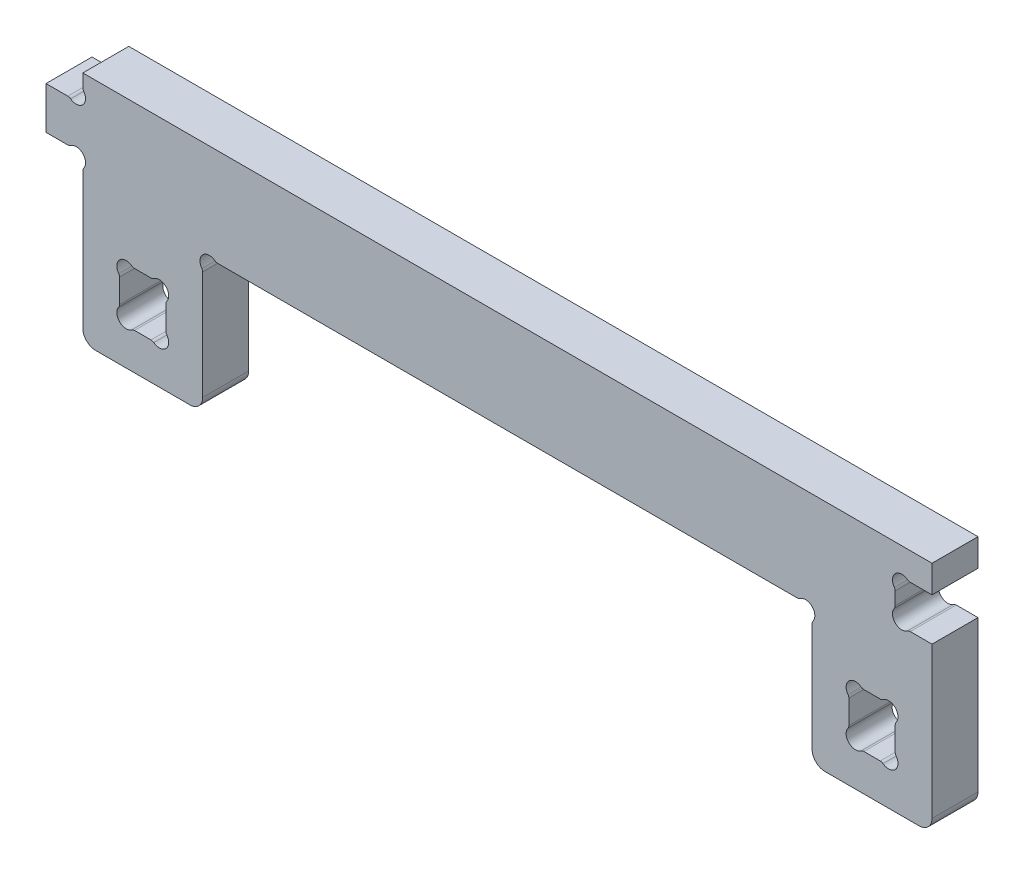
from build123d import *

# Parameters (mm, degrees)
BOSS_EXTRU_2_DEPTH = 25
CONG_1_R           = 7


with BuildPart() as part:
    # Esquisse2 → Boss.-Extru.2 (new body)
    with BuildSketch(Plane.XY):
        with BuildLine():
            Line((0, 0), (65.2, 0))
            Line((65.2, 0), (65.2, 89.066666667))
            Line((65.2, 89.066666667), (53.331040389, 89.066666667))
            ThreePointArc((53.331040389, 89.066666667), (52.547325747, 88.94064884), (51.842620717, 88.575299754))
            ThreePointArc((51.842620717, 88.575299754), (45.2, 89.066666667), (44.708633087, 95.709287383))
            ThreePointArc((44.708633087, 95.709287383), (45.073982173, 96.413992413), (45.2, 97.197707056))
            Line((45.2, 97.197707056), (45.2, 104.135626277))
            ThreePointArc((45.2, 104.135626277), (45.073982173, 104.91934092), (44.708633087, 105.62404595))
            ThreePointArc((44.708633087, 105.62404595), (45.2, 112.266666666), (51.842620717, 112.75803358))
            ThreePointArc((51.842620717, 112.75803358), (52.547325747, 112.392684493), (53.331040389, 112.266666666))
            Line((53.331040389, 112.266666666), (65.2, 112.266666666))
            Line((65.2, 112.266666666), (65.2, 127.166666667))
            Line((65.2, 127.166666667), (-396.443080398, 127.166666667))
            Line((-396.443080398, 127.166666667), (-396.443080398, 120.297707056))
            ThreePointArc((-396.443080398, 120.297707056), (-396.317062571, 119.513992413), (-395.951713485, 118.809287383))
            ThreePointArc((-395.951713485, 118.809287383), (-396.443080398, 112.166666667), (-403.085701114, 111.675299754))
            ThreePointArc((-403.085701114, 111.675299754), (-403.790406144, 112.04064884), (-404.574120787, 112.166666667))
            Line((-404.574120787, 112.166666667), (-416.443080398, 112.166666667))
            Line((-416.443080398, 112.166666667), (-416.443080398, 89.166666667))
            Line((-416.443080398, 89.166666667), (-404.574120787, 89.166666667))
            ThreePointArc((-404.574120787, 89.166666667), (-403.790406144, 89.292684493), (-403.085701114, 89.65803358))
            ThreePointArc((-403.085701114, 89.65803358), (-396.443080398, 89.166666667), (-395.951713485, 82.52404595))
            ThreePointArc((-395.951713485, 82.52404595), (-396.317062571, 81.81934092), (-396.443080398, 81.035626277))
            Line((-396.443080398, 81.035626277), (-396.443080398, 0))
            Line((-396.443080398, 0), (-331.243080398, 0))
            Line((-331.243080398, 0), (-331.243080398, 66.035626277))
            ThreePointArc((-331.243080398, 66.035626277), (-331.369098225, 66.81934092), (-331.734447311, 67.52404595))
            ThreePointArc((-331.734447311, 67.52404595), (-331.243080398, 74.166666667), (-324.600459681, 74.65803358))
            ThreePointArc((-324.600459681, 74.65803358), (-323.895754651, 74.292684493), (-323.112040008, 74.166666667))
            Line((-323.112040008, 74.166666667), (-8.131040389, 74.166666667))
            ThreePointArc((-8.131040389, 74.166666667), (-7.347325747, 74.292684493), (-6.642620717, 74.65803358))
            ThreePointArc((-6.642620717, 74.65803358), (0, 74.166666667), (0.491366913, 67.52404595))
            ThreePointArc((0.491366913, 67.52404595), (0.126017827, 66.81934092), (0, 66.035626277))
            Line((0, 66.035626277), (0, 0))
        make_face()
        with BuildLine():
            Line((45.2, 41.035626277), (45.2, 28.131040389))
            ThreePointArc((45.2, 28.131040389), (45.326017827, 27.347325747), (45.691366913, 26.642620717))
            ThreePointArc((45.691366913, 26.642620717), (45.2, 20), (38.557379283, 19.508633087))
            ThreePointArc((38.557379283, 19.508633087), (37.852674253, 19.873982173), (37.068959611, 20))
            Line((37.068959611, 20), (28.131040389, 20))
            ThreePointArc((28.131040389, 20), (27.347325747, 19.873982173), (26.642620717, 19.508633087))
            ThreePointArc((26.642620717, 19.508633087), (20, 20), (19.508633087, 26.642620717))
            ThreePointArc((19.508633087, 26.642620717), (19.873982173, 27.347325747), (20, 28.131040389))
            Line((20, 28.131040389), (20, 41.035626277))
            ThreePointArc((20, 41.035626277), (19.873982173, 41.81934092), (19.508633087, 42.52404595))
            ThreePointArc((19.508633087, 42.52404595), (20, 49.166666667), (26.642620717, 49.65803358))
            ThreePointArc((26.642620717, 49.65803358), (27.347325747, 49.292684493), (28.131040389, 49.166666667))
            Line((28.131040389, 49.166666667), (37.068959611, 49.166666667))
            ThreePointArc((37.068959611, 49.166666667), (37.852674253, 49.292684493), (38.557379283, 49.65803358))
            ThreePointArc((38.557379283, 49.65803358), (45.2, 49.166666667), (45.691366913, 42.52404595))
            ThreePointArc((45.691366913, 42.52404595), (45.326017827, 41.81934092), (45.2, 41.035626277))
        make_face(mode=Mode.SUBTRACT)
        with BuildLine():
            Line((-376.443080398, 41.035626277), (-376.443080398, 28.131040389))
            ThreePointArc((-376.443080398, 28.131040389), (-376.569098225, 27.347325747), (-376.934447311, 26.642620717))
            ThreePointArc((-376.934447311, 26.642620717), (-376.443080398, 20), (-369.800459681, 19.508633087))
            ThreePointArc((-369.800459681, 19.508633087), (-369.095754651, 19.873982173), (-368.312040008, 20))
            Line((-368.312040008, 20), (-359.374120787, 20))
            ThreePointArc((-359.374120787, 20), (-358.590406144, 19.873982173), (-357.885701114, 19.508633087))
            ThreePointArc((-357.885701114, 19.508633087), (-351.243080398, 20), (-350.751713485, 26.642620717))
            ThreePointArc((-350.751713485, 26.642620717), (-351.117062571, 27.347325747), (-351.243080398, 28.131040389))
            Line((-351.243080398, 28.131040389), (-351.243080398, 41.035626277))
            ThreePointArc((-351.243080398, 41.035626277), (-351.117062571, 41.81934092), (-350.751713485, 42.52404595))
            ThreePointArc((-350.751713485, 42.52404595), (-351.243080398, 49.166666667), (-357.885701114, 49.65803358))
            ThreePointArc((-357.885701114, 49.65803358), (-358.590406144, 49.292684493), (-359.374120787, 49.166666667))
            Line((-359.374120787, 49.166666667), (-368.312040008, 49.166666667))
            ThreePointArc((-368.312040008, 49.166666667), (-369.095754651, 49.292684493), (-369.800459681, 49.65803358))
            ThreePointArc((-369.800459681, 49.65803358), (-376.443080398, 49.166666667), (-376.934447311, 42.52404595))
            ThreePointArc((-376.934447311, 42.52404595), (-376.569098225, 41.81934092), (-376.443080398, 41.035626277))
        make_face(mode=Mode.SUBTRACT)
    extrude(amount=BOSS_EXTRU_2_DEPTH)

    # Cong_1
    cong_1_edges = [part.edges().sort_by_distance(p)[0] for p in [
        (-331.243080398, 0, 12.5),
        (-396.443080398, 0, 12.5),
        (65.2, 0, 12.5),
        (0, 0, 12.5),
    ]]
    fillet(cong_1_edges, radius=CONG_1_R)


solid = part.part
